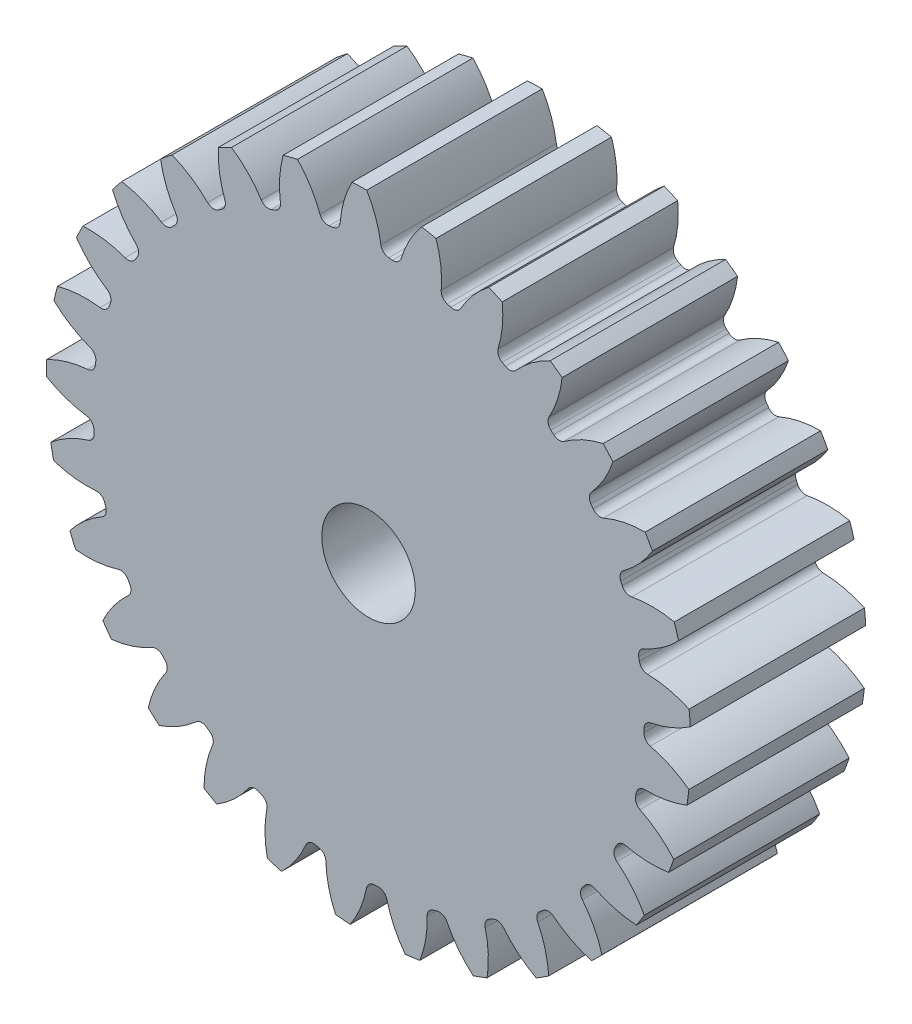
from build123d import *

# Parameters (mm, degrees)
SKETCH3_R         = 174.977777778
GEARBODY_DEPTH    = 95.25
TOOTHCUT_DEPTH    = 266.1546868
CIRPATTERN1_COUNT = 29
BOREDIA_R         = 25.4
BORE_DEPTH        = 12700


with BuildPart() as part:
    # Sketch3 → gearBody (new body)
    with BuildSketch(Plane.XY):
        Circle(SKETCH3_R)
    extrude(amount=GEARBODY_DEPTH)

    # Sketch2 → toothCut (cut, through all)
    with BuildSketch(Plane.XY):
        with BuildLine():
            ThreePointArc((149.499502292, -4.838431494), (149.528924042, -3.822627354), (149.551443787, -2.806646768))
            ThreePointArc((149.551443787, -2.806646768), (150.62675187, 0.061896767), (153.266244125, 1.616859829))
            ThreePointArc((153.266244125, 1.616859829), (164.583976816, 5.044107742), (174.977777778, 10.683788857))
            ThreePointArc((174.977777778, 10.683788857), (175.246383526, -4.480080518), (174.203322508, -19.61041783))
            ThreePointArc((174.203322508, -19.61041783), (164.11126081, -13.447026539), (152.983428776, -9.445969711))
            ThreePointArc((152.983428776, -9.445969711), (150.426835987, -7.758171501), (149.499502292, -4.838431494))
        make_face()
    toothcut = extrude(amount=TOOTHCUT_DEPTH, mode=Mode.SUBTRACT)

    # CirPattern1: toothCut ×29 about axis
    cirpattern1_axis = Axis((0, 0, 0), (0, 0, 1))
    for i in range(1, CIRPATTERN1_COUNT):
        add(toothcut.rotate(cirpattern1_axis, i * 360 / CIRPATTERN1_COUNT), mode=Mode.SUBTRACT)

    # boreDia → bore (cut, symmetric)
    with BuildSketch(Plane.XY):
        Circle(BOREDIA_R)
    extrude(amount=BORE_DEPTH, both=True, mode=Mode.SUBTRACT)


solid = part.part
